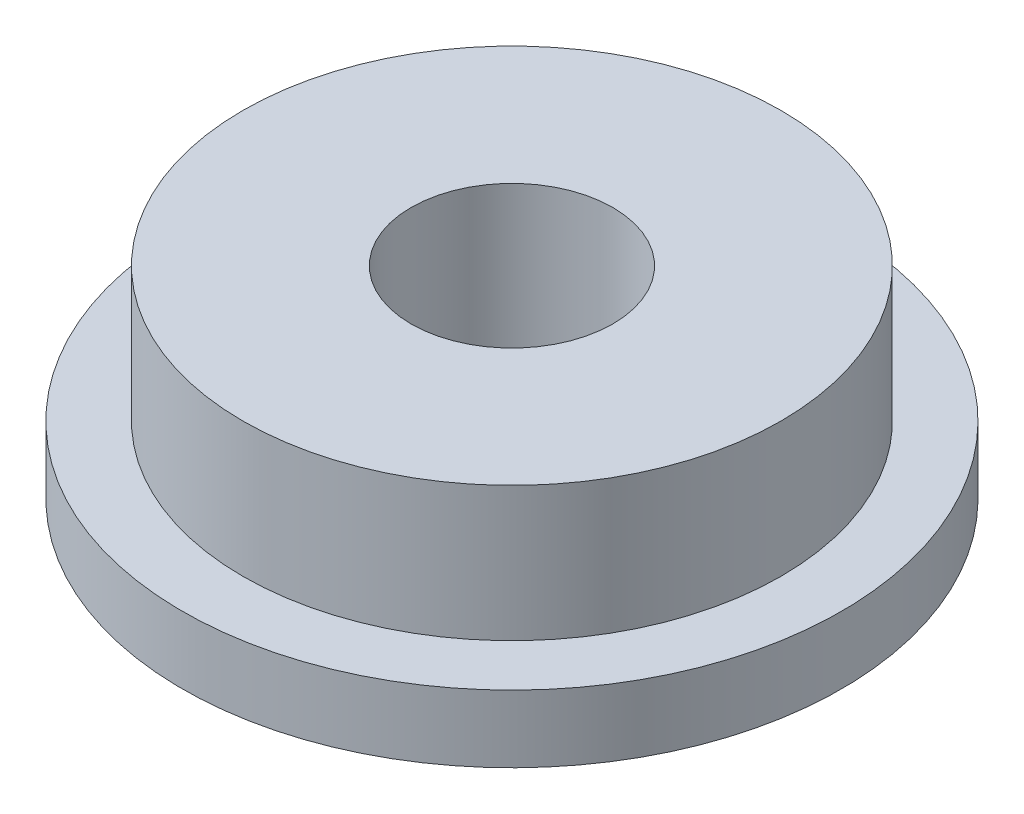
from build123d import *


with BuildPart() as part:
    # Sketch1 → Revolve1 (revolve)
    with BuildSketch(Plane.XY, mode=Mode.PRIVATE) as revolve1_sk:
        Polygon((2, 0), (2.45, 0), (2.45, -0.5), (0.75, -0.5), (0.75, 1), (2, 1), align=None)
    revolve(revolve1_sk.sketch.rotate(Axis((0, 25.272286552, 0), (0, -1, 0)), 180), axis=Axis((0, 25.272286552, 0), (0, -1, 0)))


solid = part.part
